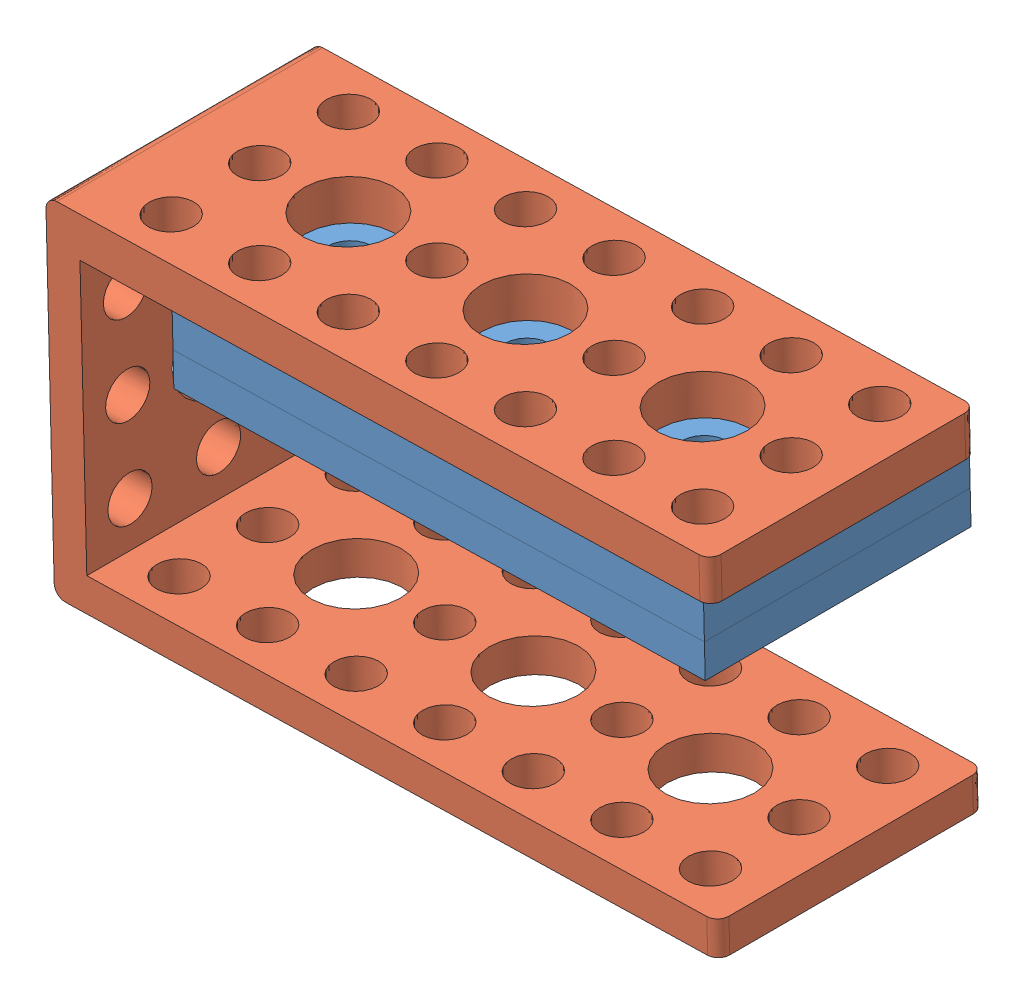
SolidWorks assembly 夹子夹子.SLDASM, configuration 默认 (file format 10000). Lengths in mm.
Overall size (60.72 32.46 24.05).
3 component instances, 2 part files, 4 mates.
Components (placement in the parent):
- 6x3-1: 6x3.SLDPRT [默认] at (-89.5856 -41.0163 78.9159) x (0.999715 0.023893 0.000018) z (0.000018 -0.001543 0.999999) size (48 3 24)
- 6x3-2: 6x3.SLDPRT [默认] at (-89.6573 -38.0172 78.9205) x (0.999715 0.023893 0.000018) z (0.000018 -0.001543 0.999999) size (48 3 24)
- 三面长脚铁-1: 三面长脚铁.SLDPRT [Default] at (-98.7995 -35.218 67.9917) x (0.023893 -0.999713 -0.001543) z (0.000018 -0.001543 0.999999) size (31 60 24)
Mates (geometry in assembly coordinates):
- 重合3: coincident aligned: circle of 6x3-1; circle of 6x3-2
- 平行1: parallel aligned: line of 6x3-1 through (-111.3842 -38.5566 91.9868) axis (0.999715 0.023893 0.000018); line of 6x3-2 through (-111.4559 -35.5575 91.9914) axis (0.999715 0.023893 0.000018)
- 重合6: coincident aligned: circle of 6x3-2; circle of 三面长脚铁-1
- 平行2: parallel anti-aligned: line of 6x3-1 through (-111.3125 -41.5558 91.9822) axis (0.999715 0.023893 0.000018); line of 三面长脚铁-1 through (-63.8849 -30.8185 91.9979) axis (-0.999715 -0.023893 -0.000018)
